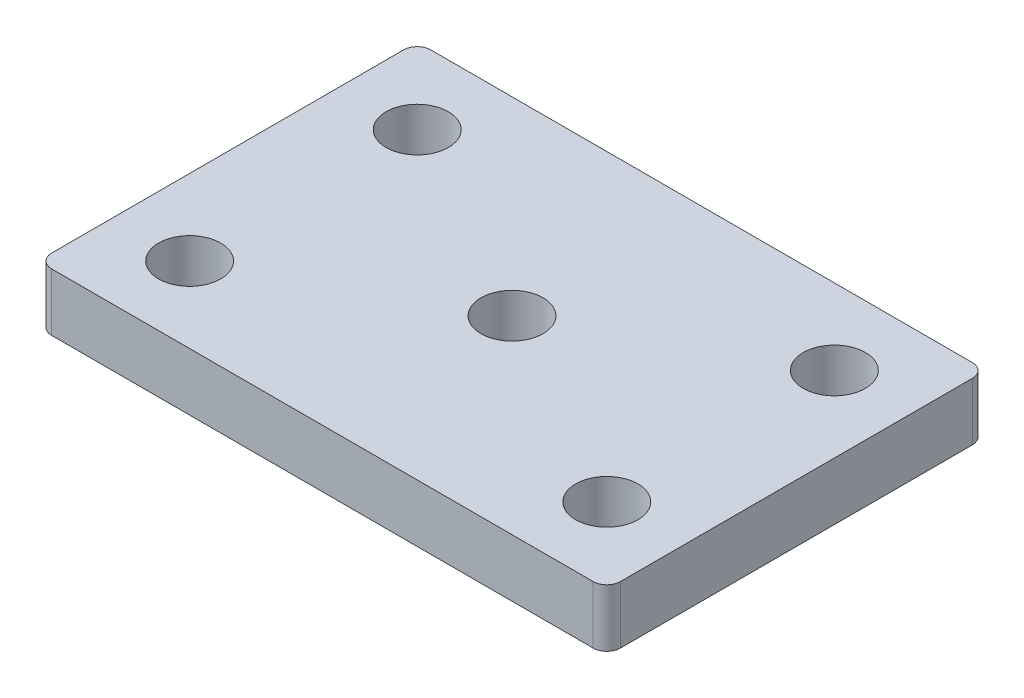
ISO-10303-21;
HEADER;
FILE_DESCRIPTION(('STEP AP214'),'2;1');
FILE_NAME('part.step','',(''),(''),'','','');
FILE_SCHEMA(('AUTOMOTIVE_DESIGN { 1 0 10303 214 1 1 1 1 }'));
ENDSEC;
DATA;
#1=APPLICATION_CONTEXT('core data for automotive mechanical design processes');
#2=APPLICATION_PROTOCOL_DEFINITION('international standard','automotive_design',2000,#1);
#3=PRODUCT_CONTEXT('',#1,'mechanical');
#4=PRODUCT('Part','Part','',(#3));
#5=PRODUCT_RELATED_PRODUCT_CATEGORY('part','',(#4));
#6=PRODUCT_DEFINITION_FORMATION('','',#4);
#7=PRODUCT_DEFINITION_CONTEXT('part definition',#1,'design');
#8=PRODUCT_DEFINITION('design','',#6,#7);
#9=PRODUCT_DEFINITION_SHAPE('','',#8);
#10=(LENGTH_UNIT() NAMED_UNIT(*) SI_UNIT(.MILLI.,.METRE.));
#11=(NAMED_UNIT(*) PLANE_ANGLE_UNIT() SI_UNIT($,.RADIAN.));
#12=(NAMED_UNIT(*) SI_UNIT($,.STERADIAN.) SOLID_ANGLE_UNIT());
#13=UNCERTAINTY_MEASURE_WITH_UNIT(LENGTH_MEASURE(1.E-05),#10,'distance_accuracy_value','');
#14=(GEOMETRIC_REPRESENTATION_CONTEXT(3) GLOBAL_UNCERTAINTY_ASSIGNED_CONTEXT((#13)) GLOBAL_UNIT_ASSIGNED_CONTEXT((#10,
#11,#12)) REPRESENTATION_CONTEXT('',''));
#15=CARTESIAN_POINT('',(0.,0.,0.));
#16=DIRECTION('',(0.,0.,1.));
#17=DIRECTION('',(1.,0.,0.));
#18=AXIS2_PLACEMENT_3D('',#15,#16,#17);
#19=CARTESIAN_POINT('',(-47.625,9.652,-31.75));
#20=DIRECTION('',(0.,-1.,0.));
#21=DIRECTION('',(0.,0.,-1.));
#22=AXIS2_PLACEMENT_3D('',#19,#20,#21);
#23=PLANE('',#22);
#24=CARTESIAN_POINT('',(-34.925,9.652,-19.05));
#25=DIRECTION('',(0.,1.,0.));
#26=DIRECTION('',(0.,0.,1.));
#27=AXIS2_PLACEMENT_3D('',#24,#25,#26);
#28=CIRCLE('',#27,5.20699999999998);
#29=CARTESIAN_POINT('',(-34.925,9.652,-13.843));
#30=VERTEX_POINT('',#29);
#31=EDGE_CURVE('E298',#30,#30,#28,.T.);
#32=ORIENTED_EDGE('',*,*,#31,.F.);
#33=EDGE_LOOP('',(#32));
#34=FACE_BOUND('',#33,.T.);
#35=CARTESIAN_POINT('',(34.925,9.652,-19.05));
#36=DIRECTION('',(0.,1.,0.));
#37=DIRECTION('',(0.,0.,1.));
#38=AXIS2_PLACEMENT_3D('',#35,#36,#37);
#39=CIRCLE('',#38,5.20699999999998);
#40=CARTESIAN_POINT('',(34.925,9.652,-13.843));
#41=VERTEX_POINT('',#40);
#42=EDGE_CURVE('E310',#41,#41,#39,.T.);
#43=ORIENTED_EDGE('',*,*,#42,.F.);
#44=EDGE_LOOP('',(#43));
#45=FACE_BOUND('',#44,.T.);
#46=DIRECTION('',(0.,0.,1.));
#47=VECTOR('',#46,1.);
#48=CARTESIAN_POINT('',(-47.625,9.652,31.75));
#49=LINE('',#48,#47);
#50=CARTESIAN_POINT('',(-47.625,9.652,-29.464));
#51=VERTEX_POINT('',#50);
#52=CARTESIAN_POINT('',(-47.625,9.652,29.464));
#53=VERTEX_POINT('',#52);
#54=EDGE_CURVE('E135',#51,#53,#49,.T.);
#55=ORIENTED_EDGE('',*,*,#54,.T.);
#56=CARTESIAN_POINT('',(-45.339,9.652,29.464));
#57=DIRECTION('',(0.,-1.,0.));
#58=DIRECTION('',(0.,0.,-1.));
#59=AXIS2_PLACEMENT_3D('',#56,#57,#58);
#60=CIRCLE('',#59,2.286);
#61=CARTESIAN_POINT('',(-45.339,9.652,31.75));
#62=VERTEX_POINT('',#61);
#63=EDGE_CURVE('E156',#53,#62,#60,.F.);
#64=ORIENTED_EDGE('',*,*,#63,.T.);
#65=DIRECTION('',(1.,0.,0.));
#66=VECTOR('',#65,1.);
#67=CARTESIAN_POINT('',(-47.625,9.652,31.75));
#68=LINE('',#67,#66);
#69=CARTESIAN_POINT('',(45.339,9.652,31.75));
#70=VERTEX_POINT('',#69);
#71=EDGE_CURVE('E117',#62,#70,#68,.T.);
#72=ORIENTED_EDGE('',*,*,#71,.T.);
#73=CARTESIAN_POINT('',(45.339,9.652,29.464));
#74=DIRECTION('',(0.,-1.,0.));
#75=DIRECTION('',(0.,0.,-1.));
#76=AXIS2_PLACEMENT_3D('',#73,#74,#75);
#77=CIRCLE('',#76,2.286);
#78=CARTESIAN_POINT('',(47.625,9.652,29.464));
#79=VERTEX_POINT('',#78);
#80=EDGE_CURVE('E151',#70,#79,#77,.F.);
#81=ORIENTED_EDGE('',*,*,#80,.T.);
#82=DIRECTION('',(0.,0.,-1.));
#83=VECTOR('',#82,1.);
#84=CARTESIAN_POINT('',(47.625,9.652,31.75));
#85=LINE('',#84,#83);
#86=CARTESIAN_POINT('',(47.625,9.652,-29.464));
#87=VERTEX_POINT('',#86);
#88=EDGE_CURVE('E139',#79,#87,#85,.T.);
#89=ORIENTED_EDGE('',*,*,#88,.T.);
#90=CARTESIAN_POINT('',(45.339,9.652,-29.464));
#91=DIRECTION('',(0.,-1.,0.));
#92=DIRECTION('',(0.,0.,-1.));
#93=AXIS2_PLACEMENT_3D('',#90,#91,#92);
#94=CIRCLE('',#93,2.286);
#95=CARTESIAN_POINT('',(45.339,9.652,-31.75));
#96=VERTEX_POINT('',#95);
#97=EDGE_CURVE('E53',#87,#96,#94,.F.);
#98=ORIENTED_EDGE('',*,*,#97,.T.);
#99=DIRECTION('',(-1.,0.,0.));
#100=VECTOR('',#99,1.);
#101=CARTESIAN_POINT('',(-47.625,9.652,-31.75));
#102=LINE('',#101,#100);
#103=CARTESIAN_POINT('',(-45.339,9.652,-31.75));
#104=VERTEX_POINT('',#103);
#105=EDGE_CURVE('E141',#96,#104,#102,.T.);
#106=ORIENTED_EDGE('',*,*,#105,.T.);
#107=CARTESIAN_POINT('',(-45.339,9.652,-29.464));
#108=DIRECTION('',(0.,-1.,0.));
#109=DIRECTION('',(0.,0.,-1.));
#110=AXIS2_PLACEMENT_3D('',#107,#108,#109);
#111=CIRCLE('',#110,2.286);
#112=EDGE_CURVE('E154',#104,#51,#111,.F.);
#113=ORIENTED_EDGE('',*,*,#112,.T.);
#114=EDGE_LOOP('',(#55,#64,#72,#81,#89,#98,#106,#113));
#115=FACE_BOUND('',#114,.T.);
#116=CARTESIAN_POINT('',(0.,9.652,0.));
#117=DIRECTION('',(0.,1.,0.));
#118=DIRECTION('',(0.,0.,1.));
#119=AXIS2_PLACEMENT_3D('',#116,#117,#118);
#120=CIRCLE('',#119,5.20700000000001);
#121=CARTESIAN_POINT('',(0.,9.652,5.20700000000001));
#122=VERTEX_POINT('',#121);
#123=EDGE_CURVE('E130',#122,#122,#120,.T.);
#124=ORIENTED_EDGE('',*,*,#123,.F.);
#125=EDGE_LOOP('',(#124));
#126=FACE_BOUND('',#125,.T.);
#127=CARTESIAN_POINT('',(34.925,9.652,19.05));
#128=DIRECTION('',(0.,1.,0.));
#129=DIRECTION('',(0.,0.,1.));
#130=AXIS2_PLACEMENT_3D('',#127,#128,#129);
#131=CIRCLE('',#130,5.20699999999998);
#132=CARTESIAN_POINT('',(34.925,9.652,24.257));
#133=VERTEX_POINT('',#132);
#134=EDGE_CURVE('E304',#133,#133,#131,.T.);
#135=ORIENTED_EDGE('',*,*,#134,.F.);
#136=EDGE_LOOP('',(#135));
#137=FACE_BOUND('',#136,.T.);
#138=CARTESIAN_POINT('',(-34.925,9.652,19.05));
#139=DIRECTION('',(0.,1.,0.));
#140=DIRECTION('',(0.,0.,1.));
#141=AXIS2_PLACEMENT_3D('',#138,#139,#140);
#142=CIRCLE('',#141,5.20699999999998);
#143=CARTESIAN_POINT('',(-34.925,9.652,24.257));
#144=VERTEX_POINT('',#143);
#145=EDGE_CURVE('E287',#144,#144,#142,.T.);
#146=ORIENTED_EDGE('',*,*,#145,.F.);
#147=EDGE_LOOP('',(#146));
#148=FACE_BOUND('',#147,.T.);
#149=ADVANCED_FACE('F31',(#34,#45,#115,#126,#137,#148),#23,.F.);
#150=CARTESIAN_POINT('',(-47.625,0.,-31.75));
#151=DIRECTION('',(0.,-1.,0.));
#152=DIRECTION('',(0.,0.,-1.));
#153=AXIS2_PLACEMENT_3D('',#150,#151,#152);
#154=PLANE('',#153);
#155=CARTESIAN_POINT('',(-34.925,0.,-19.05));
#156=DIRECTION('',(0.,1.,0.));
#157=DIRECTION('',(0.,0.,1.));
#158=AXIS2_PLACEMENT_3D('',#155,#156,#157);
#159=CIRCLE('',#158,5.20699999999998);
#160=CARTESIAN_POINT('',(-34.925,0.,-13.843));
#161=VERTEX_POINT('',#160);
#162=EDGE_CURVE('E293',#161,#161,#159,.T.);
#163=ORIENTED_EDGE('',*,*,#162,.T.);
#164=EDGE_LOOP('',(#163));
#165=FACE_BOUND('',#164,.T.);
#166=CARTESIAN_POINT('',(34.925,0.,-19.05));
#167=DIRECTION('',(0.,1.,0.));
#168=DIRECTION('',(0.,0.,1.));
#169=AXIS2_PLACEMENT_3D('',#166,#167,#168);
#170=CIRCLE('',#169,5.20699999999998);
#171=CARTESIAN_POINT('',(34.925,0.,-13.843));
#172=VERTEX_POINT('',#171);
#173=EDGE_CURVE('E307',#172,#172,#170,.T.);
#174=ORIENTED_EDGE('',*,*,#173,.T.);
#175=EDGE_LOOP('',(#174));
#176=FACE_BOUND('',#175,.T.);
#177=DIRECTION('',(1.,0.,0.));
#178=VECTOR('',#177,1.);
#179=CARTESIAN_POINT('',(-47.625,0.,31.75));
#180=LINE('',#179,#178);
#181=CARTESIAN_POINT('',(-45.339,0.,31.75));
#182=VERTEX_POINT('',#181);
#183=CARTESIAN_POINT('',(45.339,0.,31.75));
#184=VERTEX_POINT('',#183);
#185=EDGE_CURVE('E114',#182,#184,#180,.T.);
#186=ORIENTED_EDGE('',*,*,#185,.F.);
#187=CARTESIAN_POINT('',(-45.339,0.,29.464));
#188=DIRECTION('',(0.,-1.,0.));
#189=DIRECTION('',(0.,0.,-1.));
#190=AXIS2_PLACEMENT_3D('',#187,#188,#189);
#191=CIRCLE('',#190,2.286);
#192=CARTESIAN_POINT('',(-47.625,0.,29.464));
#193=VERTEX_POINT('',#192);
#194=EDGE_CURVE('E97',#182,#193,#191,.T.);
#195=ORIENTED_EDGE('',*,*,#194,.T.);
#196=DIRECTION('',(0.,0.,1.));
#197=VECTOR('',#196,1.);
#198=CARTESIAN_POINT('',(-47.625,0.,31.75));
#199=LINE('',#198,#197);
#200=CARTESIAN_POINT('',(-47.625,0.,-29.464));
#201=VERTEX_POINT('',#200);
#202=EDGE_CURVE('E125',#201,#193,#199,.T.);
#203=ORIENTED_EDGE('',*,*,#202,.F.);
#204=CARTESIAN_POINT('',(-45.339,0.,-29.464));
#205=DIRECTION('',(0.,-1.,0.));
#206=DIRECTION('',(0.,0.,-1.));
#207=AXIS2_PLACEMENT_3D('',#204,#205,#206);
#208=CIRCLE('',#207,2.286);
#209=CARTESIAN_POINT('',(-45.339,0.,-31.75));
#210=VERTEX_POINT('',#209);
#211=EDGE_CURVE('E108',#201,#210,#208,.T.);
#212=ORIENTED_EDGE('',*,*,#211,.T.);
#213=DIRECTION('',(-1.,0.,0.));
#214=VECTOR('',#213,1.);
#215=CARTESIAN_POINT('',(-47.625,0.,-31.75));
#216=LINE('',#215,#214);
#217=CARTESIAN_POINT('',(45.339,0.,-31.75));
#218=VERTEX_POINT('',#217);
#219=EDGE_CURVE('E128',#218,#210,#216,.T.);
#220=ORIENTED_EDGE('',*,*,#219,.F.);
#221=CARTESIAN_POINT('',(45.339,0.,-29.464));
#222=DIRECTION('',(0.,-1.,0.));
#223=DIRECTION('',(0.,0.,-1.));
#224=AXIS2_PLACEMENT_3D('',#221,#222,#223);
#225=CIRCLE('',#224,2.286);
#226=CARTESIAN_POINT('',(47.625,0.,-29.464));
#227=VERTEX_POINT('',#226);
#228=EDGE_CURVE('E145',#218,#227,#225,.T.);
#229=ORIENTED_EDGE('',*,*,#228,.T.);
#230=DIRECTION('',(0.,0.,-1.));
#231=VECTOR('',#230,1.);
#232=CARTESIAN_POINT('',(47.625,0.,31.75));
#233=LINE('',#232,#231);
#234=CARTESIAN_POINT('',(47.625,0.,29.464));
#235=VERTEX_POINT('',#234);
#236=EDGE_CURVE('E124',#235,#227,#233,.T.);
#237=ORIENTED_EDGE('',*,*,#236,.F.);
#238=CARTESIAN_POINT('',(45.339,0.,29.464));
#239=DIRECTION('',(0.,-1.,0.));
#240=DIRECTION('',(0.,0.,-1.));
#241=AXIS2_PLACEMENT_3D('',#238,#239,#240);
#242=CIRCLE('',#241,2.286);
#243=EDGE_CURVE('E118',#235,#184,#242,.T.);
#244=ORIENTED_EDGE('',*,*,#243,.T.);
#245=EDGE_LOOP('',(#186,#195,#203,#212,#220,#229,#237,#244));
#246=FACE_BOUND('',#245,.T.);
#247=CARTESIAN_POINT('',(0.,0.,0.));
#248=DIRECTION('',(0.,1.,0.));
#249=DIRECTION('',(0.,0.,1.));
#250=AXIS2_PLACEMENT_3D('',#247,#248,#249);
#251=CIRCLE('',#250,5.20700000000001);
#252=CARTESIAN_POINT('',(0.,0.,5.20700000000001));
#253=VERTEX_POINT('',#252);
#254=EDGE_CURVE('E313',#253,#253,#251,.T.);
#255=ORIENTED_EDGE('',*,*,#254,.T.);
#256=EDGE_LOOP('',(#255));
#257=FACE_BOUND('',#256,.T.);
#258=CARTESIAN_POINT('',(34.925,0.,19.05));
#259=DIRECTION('',(0.,1.,0.));
#260=DIRECTION('',(0.,0.,1.));
#261=AXIS2_PLACEMENT_3D('',#258,#259,#260);
#262=CIRCLE('',#261,5.20699999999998);
#263=CARTESIAN_POINT('',(34.925,0.,24.257));
#264=VERTEX_POINT('',#263);
#265=EDGE_CURVE('E301',#264,#264,#262,.T.);
#266=ORIENTED_EDGE('',*,*,#265,.T.);
#267=EDGE_LOOP('',(#266));
#268=FACE_BOUND('',#267,.T.);
#269=CARTESIAN_POINT('',(-34.925,0.,19.05));
#270=DIRECTION('',(0.,1.,0.));
#271=DIRECTION('',(0.,0.,1.));
#272=AXIS2_PLACEMENT_3D('',#269,#270,#271);
#273=CIRCLE('',#272,5.20699999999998);
#274=CARTESIAN_POINT('',(-34.925,0.,24.257));
#275=VERTEX_POINT('',#274);
#276=EDGE_CURVE('E290',#275,#275,#273,.T.);
#277=ORIENTED_EDGE('',*,*,#276,.T.);
#278=EDGE_LOOP('',(#277));
#279=FACE_BOUND('',#278,.T.);
#280=ADVANCED_FACE('F121',(#165,#176,#246,#257,#268,#279),#154,.T.);
#281=CARTESIAN_POINT('',(-47.625,9.652,31.75));
#282=DIRECTION('',(1.,0.,0.));
#283=DIRECTION('',(0.,0.,-1.));
#284=AXIS2_PLACEMENT_3D('',#281,#282,#283);
#285=PLANE('',#284);
#286=ORIENTED_EDGE('',*,*,#202,.T.);
#287=DIRECTION('',(0.,-1.,0.));
#288=VECTOR('',#287,1.);
#289=CARTESIAN_POINT('',(-47.625,9.652,29.464));
#290=LINE('',#289,#288);
#291=EDGE_CURVE('E102',#193,#53,#290,.F.);
#292=ORIENTED_EDGE('',*,*,#291,.T.);
#293=ORIENTED_EDGE('',*,*,#54,.F.);
#294=DIRECTION('',(0.,-1.,0.));
#295=VECTOR('',#294,1.);
#296=CARTESIAN_POINT('',(-47.625,9.652,-29.464));
#297=LINE('',#296,#295);
#298=EDGE_CURVE('E107',#51,#201,#297,.T.);
#299=ORIENTED_EDGE('',*,*,#298,.T.);
#300=EDGE_LOOP('',(#286,#292,#293,#299));
#301=FACE_BOUND('',#300,.T.);
#302=ADVANCED_FACE('F33',(#301),#285,.F.);
#303=CARTESIAN_POINT('',(-47.625,9.652,31.75));
#304=DIRECTION('',(0.,0.,-1.));
#305=DIRECTION('',(-1.,0.,0.));
#306=AXIS2_PLACEMENT_3D('',#303,#304,#305);
#307=PLANE('',#306);
#308=ORIENTED_EDGE('',*,*,#71,.F.);
#309=DIRECTION('',(0.,-1.,0.));
#310=VECTOR('',#309,1.);
#311=CARTESIAN_POINT('',(-45.339,9.652,31.75));
#312=LINE('',#311,#310);
#313=EDGE_CURVE('E101',#62,#182,#312,.T.);
#314=ORIENTED_EDGE('',*,*,#313,.T.);
#315=ORIENTED_EDGE('',*,*,#185,.T.);
#316=DIRECTION('',(0.,-1.,0.));
#317=VECTOR('',#316,1.);
#318=CARTESIAN_POINT('',(45.339,9.652,31.75));
#319=LINE('',#318,#317);
#320=EDGE_CURVE('E119',#184,#70,#319,.F.);
#321=ORIENTED_EDGE('',*,*,#320,.T.);
#322=EDGE_LOOP('',(#308,#314,#315,#321));
#323=FACE_BOUND('',#322,.T.);
#324=ADVANCED_FACE('F113',(#323),#307,.F.);
#325=CARTESIAN_POINT('',(47.625,9.652,31.75));
#326=DIRECTION('',(-1.,0.,0.));
#327=DIRECTION('',(0.,0.,1.));
#328=AXIS2_PLACEMENT_3D('',#325,#326,#327);
#329=PLANE('',#328);
#330=ORIENTED_EDGE('',*,*,#236,.T.);
#331=DIRECTION('',(0.,-1.,0.));
#332=VECTOR('',#331,1.);
#333=CARTESIAN_POINT('',(47.625,9.652,-29.464));
#334=LINE('',#333,#332);
#335=EDGE_CURVE('E11',#227,#87,#334,.F.);
#336=ORIENTED_EDGE('',*,*,#335,.T.);
#337=ORIENTED_EDGE('',*,*,#88,.F.);
#338=DIRECTION('',(0.,-1.,0.));
#339=VECTOR('',#338,1.);
#340=CARTESIAN_POINT('',(47.625,9.652,29.464));
#341=LINE('',#340,#339);
#342=EDGE_CURVE('E39',#79,#235,#341,.T.);
#343=ORIENTED_EDGE('',*,*,#342,.T.);
#344=EDGE_LOOP('',(#330,#336,#337,#343));
#345=FACE_BOUND('',#344,.T.);
#346=ADVANCED_FACE('F165',(#345),#329,.F.);
#347=CARTESIAN_POINT('',(-47.625,9.652,-31.75));
#348=DIRECTION('',(0.,0.,1.));
#349=DIRECTION('',(1.,0.,0.));
#350=AXIS2_PLACEMENT_3D('',#347,#348,#349);
#351=PLANE('',#350);
#352=ORIENTED_EDGE('',*,*,#219,.T.);
#353=DIRECTION('',(0.,-1.,0.));
#354=VECTOR('',#353,1.);
#355=CARTESIAN_POINT('',(-45.339,9.652,-31.75));
#356=LINE('',#355,#354);
#357=EDGE_CURVE('E46',#210,#104,#356,.F.);
#358=ORIENTED_EDGE('',*,*,#357,.T.);
#359=ORIENTED_EDGE('',*,*,#105,.F.);
#360=DIRECTION('',(0.,-1.,0.));
#361=VECTOR('',#360,1.);
#362=CARTESIAN_POINT('',(45.339,9.652,-31.75));
#363=LINE('',#362,#361);
#364=EDGE_CURVE('E158',#96,#218,#363,.T.);
#365=ORIENTED_EDGE('',*,*,#364,.T.);
#366=EDGE_LOOP('',(#352,#358,#359,#365));
#367=FACE_BOUND('',#366,.T.);
#368=ADVANCED_FACE('F173',(#367),#351,.F.);
#369=CARTESIAN_POINT('',(0.,9.652,0.));
#370=DIRECTION('',(0.,-1.,0.));
#371=DIRECTION('',(0.,0.,-1.));
#372=AXIS2_PLACEMENT_3D('',#369,#370,#371);
#373=CYLINDRICAL_SURFACE('',#372,5.20700000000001);
#374=ORIENTED_EDGE('',*,*,#123,.T.);
#375=EDGE_LOOP('',(#374));
#376=FACE_BOUND('',#375,.T.);
#377=ORIENTED_EDGE('',*,*,#254,.F.);
#378=EDGE_LOOP('',(#377));
#379=FACE_BOUND('',#378,.T.);
#380=ADVANCED_FACE('F203',(#376,#379),#373,.F.);
#381=CARTESIAN_POINT('',(34.925,9.652,-19.05));
#382=DIRECTION('',(0.,-1.,0.));
#383=DIRECTION('',(0.,0.,-1.));
#384=AXIS2_PLACEMENT_3D('',#381,#382,#383);
#385=CYLINDRICAL_SURFACE('',#384,5.20699999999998);
#386=ORIENTED_EDGE('',*,*,#42,.T.);
#387=EDGE_LOOP('',(#386));
#388=FACE_BOUND('',#387,.T.);
#389=ORIENTED_EDGE('',*,*,#173,.F.);
#390=EDGE_LOOP('',(#389));
#391=FACE_BOUND('',#390,.T.);
#392=ADVANCED_FACE('F235',(#388,#391),#385,.F.);
#393=CARTESIAN_POINT('',(34.925,9.652,19.05));
#394=DIRECTION('',(0.,-1.,0.));
#395=DIRECTION('',(0.,0.,-1.));
#396=AXIS2_PLACEMENT_3D('',#393,#394,#395);
#397=CYLINDRICAL_SURFACE('',#396,5.20699999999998);
#398=ORIENTED_EDGE('',*,*,#134,.T.);
#399=EDGE_LOOP('',(#398));
#400=FACE_BOUND('',#399,.T.);
#401=ORIENTED_EDGE('',*,*,#265,.F.);
#402=EDGE_LOOP('',(#401));
#403=FACE_BOUND('',#402,.T.);
#404=ADVANCED_FACE('F242',(#400,#403),#397,.F.);
#405=CARTESIAN_POINT('',(-34.925,9.652,-19.05));
#406=DIRECTION('',(0.,-1.,0.));
#407=DIRECTION('',(0.,0.,-1.));
#408=AXIS2_PLACEMENT_3D('',#405,#406,#407);
#409=CYLINDRICAL_SURFACE('',#408,5.20699999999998);
#410=ORIENTED_EDGE('',*,*,#31,.T.);
#411=EDGE_LOOP('',(#410));
#412=FACE_BOUND('',#411,.T.);
#413=ORIENTED_EDGE('',*,*,#162,.F.);
#414=EDGE_LOOP('',(#413));
#415=FACE_BOUND('',#414,.T.);
#416=ADVANCED_FACE('F250',(#412,#415),#409,.F.);
#417=CARTESIAN_POINT('',(-34.925,9.652,19.05));
#418=DIRECTION('',(0.,-1.,0.));
#419=DIRECTION('',(0.,0.,-1.));
#420=AXIS2_PLACEMENT_3D('',#417,#418,#419);
#421=CYLINDRICAL_SURFACE('',#420,5.20699999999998);
#422=ORIENTED_EDGE('',*,*,#145,.T.);
#423=EDGE_LOOP('',(#422));
#424=FACE_BOUND('',#423,.T.);
#425=ORIENTED_EDGE('',*,*,#276,.F.);
#426=EDGE_LOOP('',(#425));
#427=FACE_BOUND('',#426,.T.);
#428=ADVANCED_FACE('F258',(#424,#427),#421,.F.);
#429=CARTESIAN_POINT('',(-45.339,9.652,29.464));
#430=DIRECTION('',(0.,-1.,0.));
#431=DIRECTION('',(0.,0.,-1.));
#432=AXIS2_PLACEMENT_3D('',#429,#430,#431);
#433=CYLINDRICAL_SURFACE('',#432,2.286);
#434=ORIENTED_EDGE('',*,*,#63,.F.);
#435=ORIENTED_EDGE('',*,*,#291,.F.);
#436=ORIENTED_EDGE('',*,*,#194,.F.);
#437=ORIENTED_EDGE('',*,*,#313,.F.);
#438=EDGE_LOOP('',(#434,#435,#436,#437));
#439=FACE_BOUND('',#438,.T.);
#440=ADVANCED_FACE('F100',(#439),#433,.T.);
#441=CARTESIAN_POINT('',(-45.339,9.652,-29.464));
#442=DIRECTION('',(0.,-1.,0.));
#443=DIRECTION('',(0.,0.,-1.));
#444=AXIS2_PLACEMENT_3D('',#441,#442,#443);
#445=CYLINDRICAL_SURFACE('',#444,2.286);
#446=ORIENTED_EDGE('',*,*,#112,.F.);
#447=ORIENTED_EDGE('',*,*,#357,.F.);
#448=ORIENTED_EDGE('',*,*,#211,.F.);
#449=ORIENTED_EDGE('',*,*,#298,.F.);
#450=EDGE_LOOP('',(#446,#447,#448,#449));
#451=FACE_BOUND('',#450,.T.);
#452=ADVANCED_FACE('F179',(#451),#445,.T.);
#453=CARTESIAN_POINT('',(45.339,9.652,-29.464));
#454=DIRECTION('',(0.,-1.,0.));
#455=DIRECTION('',(0.,0.,-1.));
#456=AXIS2_PLACEMENT_3D('',#453,#454,#455);
#457=CYLINDRICAL_SURFACE('',#456,2.286);
#458=ORIENTED_EDGE('',*,*,#97,.F.);
#459=ORIENTED_EDGE('',*,*,#335,.F.);
#460=ORIENTED_EDGE('',*,*,#228,.F.);
#461=ORIENTED_EDGE('',*,*,#364,.F.);
#462=EDGE_LOOP('',(#458,#459,#460,#461));
#463=FACE_BOUND('',#462,.T.);
#464=ADVANCED_FACE('F172',(#463),#457,.T.);
#465=CARTESIAN_POINT('',(45.339,9.652,29.464));
#466=DIRECTION('',(0.,-1.,0.));
#467=DIRECTION('',(0.,0.,-1.));
#468=AXIS2_PLACEMENT_3D('',#465,#466,#467);
#469=CYLINDRICAL_SURFACE('',#468,2.286);
#470=ORIENTED_EDGE('',*,*,#80,.F.);
#471=ORIENTED_EDGE('',*,*,#320,.F.);
#472=ORIENTED_EDGE('',*,*,#243,.F.);
#473=ORIENTED_EDGE('',*,*,#342,.F.);
#474=EDGE_LOOP('',(#470,#471,#472,#473));
#475=FACE_BOUND('',#474,.T.);
#476=ADVANCED_FACE('F181',(#475),#469,.T.);
#477=CLOSED_SHELL('',(#149,#280,#302,#324,#346,#368,#380,#392,#404,#416,#428,#440,#452,#464,#476));
#478=MANIFOLD_SOLID_BREP('B2',#477);
#479=ADVANCED_BREP_SHAPE_REPRESENTATION('',(#18,#478),#14);
#480=SHAPE_DEFINITION_REPRESENTATION(#9,#479);
ENDSEC;
END-ISO-10303-21;
